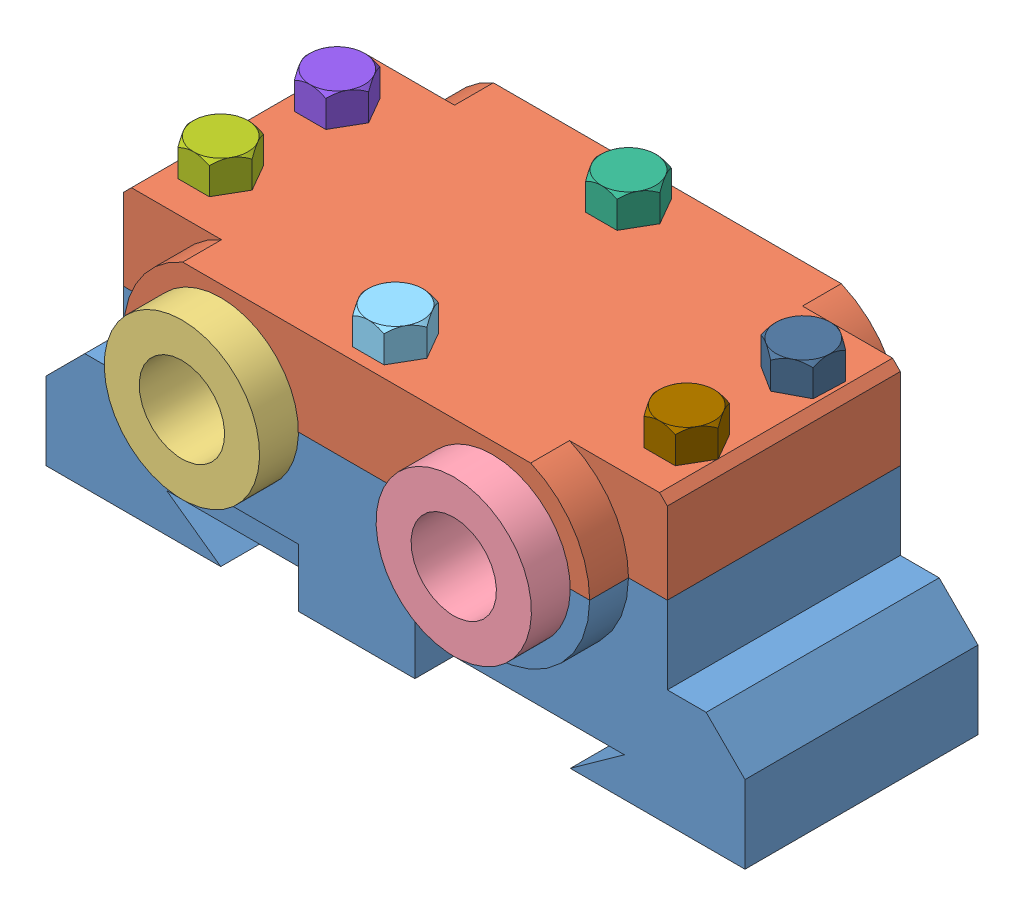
SolidWorks assembly Assem1.sldasm, configuration Default (file format 14000). Lengths in mm.
Overall size (90 40.5 45).
10 component instances, 10 part files, 19 mates.
Components (placement in the parent):
- 1.Base-1: 1.Base.SLDPRT [Default] at (25.9824 28.874 76.8993) size (90 25 40)
- 2-1: 2.SLDPRT [Default] at (25.9824 53.874 76.8993) size (70 11.5 40)
- 3.1-1: 3.1.SLDPRT [Default] at (8.4824 53.874 96.8993) x (1 0 0) z (0 -1 0) size (20 45 20)
- 3.2-1: 3.2.SLDPRT [Default] at (43.4824 53.874 96.8993) x (1 0 0) z (0 -1 0) size (20 45 20)
- 4.1-1: 4.1.SLDPRT [Default] at (25.9824 65.374 91.8993) size (8.89 29 7)
- 4.2-1: 4.2.SLDPRT [Default] at (25.9824 65.374 61.8993) size (8.89 29 7)
- 4.3-1: 4.3.SLDPRT [Default] at (-4.0176 65.374 84.3993) size (8.89 29 7)
- 4.4-1: 4.4.SLDPRT [Default] at (-4.0176 65.374 69.3993) size (8.89 29 7)
- 4.5-1: 4.5.SLDPRT [Default] at (55.9824 65.374 84.3993) size (8.89 29 7)
- 4.63-1: 4.63.SLDPRT [Default] at (55.9824 65.374 69.3993) x (-0.845691 0 -0.533673) z (0.533673 0 -0.845691) size (8.89 29 7)
Mates (geometry in assembly coordinates):
- Concentric1: concentric anti-aligned: cylinder of 1.Base-1 through (8.4824 53.874 96.8993) axis (0 0 -1) radius 7.5; cylinder of 3.1-1 through (8.4824 53.874 56.8993) axis (0 0 1) radius 7.5
- Concentric2: concentric anti-aligned: cylinder of 1.Base-1 through (43.4824 53.874 96.8993) axis (0 0 -1) radius 7.5; cylinder of 3.2-1 through (43.4824 53.874 56.8993) axis (0 0 1) radius 7.5
- Coincident1: coincident anti-aligned: plane of 1.Base-1 through (25.9824 28.874 96.8993) normal (0 0 1); plane of 3.2-1 through (43.4824 53.874 96.8993) normal (0 0 -1)
- Coincident2: coincident anti-aligned: plane of 1.Base-1 through (25.9824 28.874 96.8993) normal (0 0 1); plane of 3.1-1 through (8.4824 53.874 96.8993) normal (0 0 -1)
- Concentric3: concentric anti-aligned: cylinder of 2-1 through (43.4824 53.874 96.8993) axis (0 0 -1) radius 7.5; cylinder of 3.2-1 through (43.4824 53.874 56.8993) axis (0 0 1) radius 7.5
- Coincident3: coincident aligned: plane of 1.Base-1 through (25.9824 28.874 56.8993) normal (0 0 -1); plane of 2-1 through (8.4839 54.1914 56.8993) normal (0 0 -1)
- Concentric4: concentric aligned: cylinder of 2-1 through (-4.0156 54.3048 69.3993) axis (0.009068 0.999959 0) radius 2.25; cylinder of 4.4-1 through (-4.138 40.8053 69.3993) axis (0.009068 0.999959 0) radius 2.25
- Coincident4: coincident anti-aligned: plane of 2-1 through (26.0874 65.5322 76.8993) normal (0.009068 0.999959 0); plane of 4.4-1 through (-3.9113 65.8043 69.3993) normal (-0.009068 -0.999959 0)
- Concentric5: concentric aligned: cylinder of 2-1 through (-4.0156 54.3048 84.3993) axis (0.009068 0.999959 0) radius 2.25; cylinder of 4.3-1 through (-4.138 40.8053 84.3993) axis (0.009068 0.999959 0) radius 2.25
- Coincident5: coincident anti-aligned: plane of 2-1 through (26.0874 65.5322 76.8993) normal (0.009068 0.999959 0); plane of 4.3-1 through (-3.9113 65.8043 84.3993) normal (-0.009068 -0.999959 0)
- Concentric6: concentric aligned: cylinder of 2-1 through (25.9832 54.0327 61.8993) axis (0.009068 0.999959 0) radius 2.25; cylinder of 4.2-1 through (25.8607 40.5333 61.8993) axis (0.009068 0.999959 0) radius 2.25
- Coincident6: coincident anti-aligned: plane of 2-1 through (26.0874 65.5322 76.8993) normal (0.009068 0.999959 0); plane of 4.2-1 through (26.0874 65.5322 61.8993) normal (-0.009068 -0.999959 0)
- Concentric7: concentric aligned: cylinder of 2-1 through (25.9832 54.0327 91.8993) axis (0.009068 0.999959 0) radius 2.25; cylinder of 4.1-1 through (25.8607 40.5333 91.8993) axis (0.009068 0.999959 0) radius 2.25
- Coincident7: coincident anti-aligned: plane of 2-1 through (26.0874 65.5322 76.8993) normal (0.009068 0.999959 0); plane of 4.1-1 through (26.0874 65.5322 91.8993) normal (-0.009068 -0.999959 0)
- Concentric8: concentric aligned: cylinder of 2-1 through (55.9819 53.7607 84.3993) axis (0.009068 0.999959 0) radius 2.25; cylinder of 4.5-1 through (55.8595 40.2612 84.3993) axis (0.009068 0.999959 0) radius 2.25
- Concentric9: concentric aligned: cylinder of 2-1 through (55.9819 53.7607 69.3993) axis (0.009068 0.999959 0) radius 2.25; cylinder of 4.63-1 through (55.8595 40.2612 69.3993) axis (0.009068 0.999959 0) radius 2.25
- Coincident8: coincident anti-aligned: plane of 2-1 through (26.0874 65.5322 76.8993) normal (0.009068 0.999959 0); plane of 4.5-1 through (56.0862 65.2602 84.3993) normal (-0.009068 -0.999959 0)
- Coincident9: coincident anti-aligned: plane of 2-1 through (25.9824 65.374 76.8993) normal (0 1 0); plane of 4.63-1 through (55.9824 65.374 69.3993) normal (0 -1 0)
- Coincident10: coincident anti-aligned: line of 1.Base-1 through (-9.0176 53.874 91.8993) axis (0 0 -1); line of 2-1 through (-9.0176 53.874 61.8993) axis (0 0 1)
